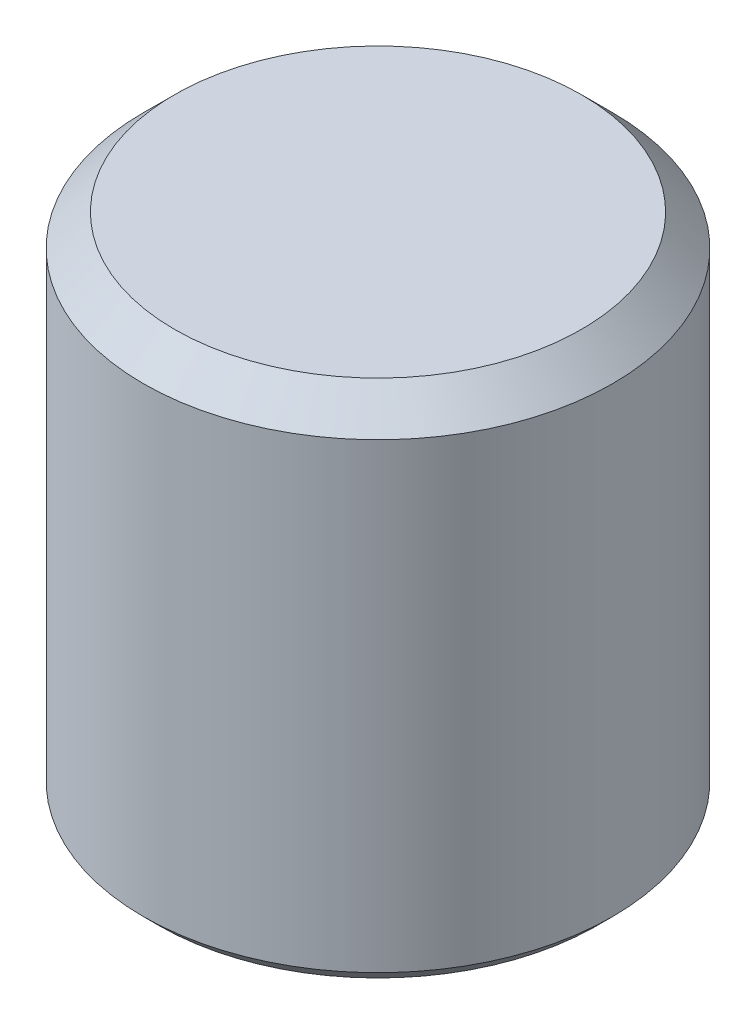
ISO-10303-21;
HEADER;
FILE_DESCRIPTION(('STEP AP214'),'2;1');
FILE_NAME('part.step','',(''),(''),'','','');
FILE_SCHEMA(('AUTOMOTIVE_DESIGN { 1 0 10303 214 1 1 1 1 }'));
ENDSEC;
DATA;
#1=APPLICATION_CONTEXT('core data for automotive mechanical design processes');
#2=APPLICATION_PROTOCOL_DEFINITION('international standard','automotive_design',2000,#1);
#3=PRODUCT_CONTEXT('',#1,'mechanical');
#4=PRODUCT('Part','Part','',(#3));
#5=PRODUCT_RELATED_PRODUCT_CATEGORY('part','',(#4));
#6=PRODUCT_DEFINITION_FORMATION('','',#4);
#7=PRODUCT_DEFINITION_CONTEXT('part definition',#1,'design');
#8=PRODUCT_DEFINITION('design','',#6,#7);
#9=PRODUCT_DEFINITION_SHAPE('','',#8);
#10=(LENGTH_UNIT() NAMED_UNIT(*) SI_UNIT(.MILLI.,.METRE.));
#11=(NAMED_UNIT(*) PLANE_ANGLE_UNIT() SI_UNIT($,.RADIAN.));
#12=(NAMED_UNIT(*) SI_UNIT($,.STERADIAN.) SOLID_ANGLE_UNIT());
#13=UNCERTAINTY_MEASURE_WITH_UNIT(LENGTH_MEASURE(1.E-05),#10,'distance_accuracy_value','');
#14=(GEOMETRIC_REPRESENTATION_CONTEXT(3) GLOBAL_UNCERTAINTY_ASSIGNED_CONTEXT((#13)) GLOBAL_UNIT_ASSIGNED_CONTEXT((#10,
#11,#12)) REPRESENTATION_CONTEXT('',''));
#15=CARTESIAN_POINT('',(0.,0.,0.));
#16=DIRECTION('',(0.,0.,1.));
#17=DIRECTION('',(1.,0.,0.));
#18=AXIS2_PLACEMENT_3D('',#15,#16,#17);
#19=CARTESIAN_POINT('',(0.,13.,0.));
#20=DIRECTION('',(0.,-1.,0.));
#21=DIRECTION('',(0.,0.,-1.));
#22=AXIS2_PLACEMENT_3D('',#19,#20,#21);
#23=CYLINDRICAL_SURFACE('',#22,6.);
#24=CARTESIAN_POINT('',(0.,0.40000000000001,0.));
#25=DIRECTION('',(0.,1.,0.));
#26=DIRECTION('',(0.,0.,1.));
#27=AXIS2_PLACEMENT_3D('',#24,#25,#26);
#28=CIRCLE('',#27,6.);
#29=CARTESIAN_POINT('',(0.,0.400000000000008,-6.));
#30=VERTEX_POINT('',#29);
#31=EDGE_CURVE('E10',#30,#30,#28,.T.);
#32=CARTESIAN_POINT('',(0.,12.2,0.));
#33=DIRECTION('',(0.,1.,0.));
#34=DIRECTION('',(0.,0.,1.));
#35=AXIS2_PLACEMENT_3D('',#32,#33,#34);
#36=CIRCLE('',#35,6.);
#37=CARTESIAN_POINT('',(0.,12.2,-6.));
#38=VERTEX_POINT('',#37);
#39=EDGE_CURVE('E59',#38,#38,#36,.F.);
#40=CARTESIAN_POINT('',(0.,0.400000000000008,-6.));
#41=CARTESIAN_POINT('',(0.,0.522916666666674,-6.));
#42=CARTESIAN_POINT('',(0.,0.645833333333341,-6.));
#43=CARTESIAN_POINT('',(0.,0.891666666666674,-6.));
#44=CARTESIAN_POINT('',(0.,1.01458333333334,-6.));
#45=CARTESIAN_POINT('',(0.,1.26041666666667,-6.));
#46=CARTESIAN_POINT('',(0.,1.38333333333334,-6.));
#47=CARTESIAN_POINT('',(0.,1.62916666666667,-6.));
#48=CARTESIAN_POINT('',(0.,1.75208333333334,-6.));
#49=CARTESIAN_POINT('',(0.,1.99791666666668,-6.));
#50=CARTESIAN_POINT('',(0.,2.12083333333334,-6.));
#51=CARTESIAN_POINT('',(0.,2.36666666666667,-6.));
#52=CARTESIAN_POINT('',(0.,2.48958333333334,-6.));
#53=CARTESIAN_POINT('',(0.,2.73541666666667,-6.));
#54=CARTESIAN_POINT('',(0.,2.85833333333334,-6.));
#55=CARTESIAN_POINT('',(0.,3.10416666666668,-6.));
#56=CARTESIAN_POINT('',(0.,3.22708333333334,-6.));
#57=CARTESIAN_POINT('',(0.,3.47291666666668,-6.));
#58=CARTESIAN_POINT('',(0.,3.59583333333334,-6.));
#59=CARTESIAN_POINT('',(0.,3.84166666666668,-6.));
#60=CARTESIAN_POINT('',(0.,3.96458333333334,-6.));
#61=CARTESIAN_POINT('',(0.,4.21041666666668,-6.));
#62=CARTESIAN_POINT('',(0.,4.33333333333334,-6.));
#63=CARTESIAN_POINT('',(0.,4.57916666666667,-6.));
#64=CARTESIAN_POINT('',(0.,4.70208333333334,-6.));
#65=CARTESIAN_POINT('',(0.,4.94791666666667,-6.));
#66=CARTESIAN_POINT('',(0.,5.07083333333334,-6.));
#67=CARTESIAN_POINT('',(0.,5.31666666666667,-6.));
#68=CARTESIAN_POINT('',(0.,5.43958333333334,-6.));
#69=CARTESIAN_POINT('',(0.,5.68541666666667,-6.));
#70=CARTESIAN_POINT('',(0.,5.80833333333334,-6.));
#71=CARTESIAN_POINT('',(0.,6.05416666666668,-6.));
#72=CARTESIAN_POINT('',(0.,6.17708333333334,-6.));
#73=CARTESIAN_POINT('',(0.,6.42291666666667,-6.));
#74=CARTESIAN_POINT('',(0.,6.54583333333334,-6.));
#75=CARTESIAN_POINT('',(0.,6.79166666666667,-6.));
#76=CARTESIAN_POINT('',(0.,6.91458333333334,-6.));
#77=CARTESIAN_POINT('',(0.,7.16041666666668,-6.));
#78=CARTESIAN_POINT('',(0.,7.28333333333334,-6.));
#79=CARTESIAN_POINT('',(0.,7.52916666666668,-6.));
#80=CARTESIAN_POINT('',(0.,7.65208333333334,-6.));
#81=CARTESIAN_POINT('',(0.,7.89791666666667,-6.));
#82=CARTESIAN_POINT('',(0.,8.02083333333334,-6.));
#83=CARTESIAN_POINT('',(0.,8.26666666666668,-6.));
#84=CARTESIAN_POINT('',(0.,8.38958333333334,-6.));
#85=CARTESIAN_POINT('',(0.,8.63541666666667,-6.));
#86=CARTESIAN_POINT('',(0.,8.75833333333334,-6.));
#87=CARTESIAN_POINT('',(0.,9.00416666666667,-6.));
#88=CARTESIAN_POINT('',(0.,9.12708333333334,-6.));
#89=CARTESIAN_POINT('',(0.,9.37291666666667,-6.));
#90=CARTESIAN_POINT('',(0.,9.49583333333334,-6.));
#91=CARTESIAN_POINT('',(0.,9.74166666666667,-6.));
#92=CARTESIAN_POINT('',(0.,9.86458333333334,-6.));
#93=CARTESIAN_POINT('',(0.,10.1104166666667,-6.));
#94=CARTESIAN_POINT('',(0.,10.2333333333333,-6.));
#95=CARTESIAN_POINT('',(0.,10.4791666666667,-6.));
#96=CARTESIAN_POINT('',(0.,10.6020833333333,-6.));
#97=CARTESIAN_POINT('',(0.,10.8479166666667,-6.));
#98=CARTESIAN_POINT('',(0.,10.9708333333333,-6.));
#99=CARTESIAN_POINT('',(0.,11.2166666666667,-6.));
#100=CARTESIAN_POINT('',(0.,11.3395833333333,-6.));
#101=CARTESIAN_POINT('',(0.,11.5854166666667,-6.));
#102=CARTESIAN_POINT('',(0.,11.7083333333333,-6.));
#103=CARTESIAN_POINT('',(0.,11.9541666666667,-6.));
#104=CARTESIAN_POINT('',(0.,12.0770833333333,-6.));
#105=CARTESIAN_POINT('',(0.,12.2,-6.));
#106=B_SPLINE_CURVE_WITH_KNOTS('',3,(#40,#41,#42,#43,#44,#45,#46,#47,#48,#49,#50,#51,#52,#53,
#54,#55,#56,#57,#58,#59,#60,#61,#62,#63,#64,#65,#66,#67,#68,#69,#70,#71,#72,#73,#74,#75,#76,#77,
#78,#79,#80,#81,#82,#83,#84,#85,#86,#87,#88,#89,#90,#91,#92,#93,#94,#95,#96,#97,#98,#99,#100,
#101,#102,#103,#104,#105),.UNSPECIFIED.,.F.,.F.,(4,2,2,2,2,2,2,2,2,2,2,2,2,2,2,2,2,2,2,2,2,2,2,
2,2,2,2,2,2,2,2,2,4),(0.,0.368749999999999,0.7375,1.10625,1.475,1.84375,2.2125,2.58125,2.95,
3.31875,3.6875,4.05625,4.425,4.79375,5.1625,5.53125,5.9,6.26875,6.6375,7.00625,7.375,7.74375,
8.1125,8.48125,8.85,9.21875,9.5875,9.95625,10.325,10.69375,11.0625,11.43125,11.8),.UNSPECIFIED.);
#107=EDGE_CURVE('BSEAM35',#30,#38,#106,.T.);
#108=ORIENTED_EDGE('',*,*,#31,.T.);
#109=ORIENTED_EDGE('',*,*,#39,.T.);
#110=ORIENTED_EDGE('',*,*,#107,.T.);
#111=ORIENTED_EDGE('',*,*,#107,.F.);
#112=EDGE_LOOP('',(#108,#110,#109,#111));
#113=FACE_BOUND('',#112,.T.);
#114=ADVANCED_FACE('F35',(#113),#23,.T.);
#115=CARTESIAN_POINT('',(0.,13.,0.));
#116=DIRECTION('',(0.,1.,0.));
#117=DIRECTION('',(0.,0.,1.));
#118=AXIS2_PLACEMENT_3D('',#115,#116,#117);
#119=PLANE('',#118);
#120=CARTESIAN_POINT('',(0.,13.,0.));
#121=DIRECTION('',(0.,1.,0.));
#122=DIRECTION('',(0.,0.,1.));
#123=AXIS2_PLACEMENT_3D('',#120,#121,#122);
#124=CIRCLE('',#123,5.20000000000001);
#125=CARTESIAN_POINT('',(0.,13.,5.20000000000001));
#126=VERTEX_POINT('',#125);
#127=EDGE_CURVE('E63',#126,#126,#124,.T.);
#128=ORIENTED_EDGE('',*,*,#127,.T.);
#129=EDGE_LOOP('',(#128));
#130=FACE_BOUND('',#129,.T.);
#131=ADVANCED_FACE('F85',(#130),#119,.T.);
#132=CARTESIAN_POINT('',(0.,0.,0.));
#133=DIRECTION('',(0.,1.,0.));
#134=DIRECTION('',(0.,0.,1.));
#135=AXIS2_PLACEMENT_3D('',#132,#133,#134);
#136=PLANE('',#135);
#137=CARTESIAN_POINT('',(0.,0.,0.));
#138=DIRECTION('',(0.,1.,0.));
#139=DIRECTION('',(0.,0.,1.));
#140=AXIS2_PLACEMENT_3D('',#137,#138,#139);
#141=CIRCLE('',#140,5.40000000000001);
#142=CARTESIAN_POINT('',(0.,0.,5.40000000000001));
#143=VERTEX_POINT('',#142);
#144=EDGE_CURVE('E43',#143,#143,#141,.T.);
#145=ORIENTED_EDGE('',*,*,#144,.T.);
#146=EDGE_LOOP('',(#145));
#147=FACE_BOUND('',#146,.T.);
#148=CARTESIAN_POINT('',(0.,0.,0.));
#149=DIRECTION('',(0.,1.,0.));
#150=DIRECTION('',(0.,0.,1.));
#151=AXIS2_PLACEMENT_3D('',#148,#149,#150);
#152=CIRCLE('',#151,5.59999999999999);
#153=CARTESIAN_POINT('',(0.,0.,5.59999999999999));
#154=VERTEX_POINT('',#153);
#155=EDGE_CURVE('E49',#154,#154,#152,.F.);
#156=ORIENTED_EDGE('',*,*,#155,.T.);
#157=EDGE_LOOP('',(#156));
#158=FACE_BOUND('',#157,.T.);
#159=ADVANCED_FACE('F76',(#147,#158),#136,.F.);
#160=CARTESIAN_POINT('',(0.,10.,0.));
#161=DIRECTION('',(0.,-1.,0.));
#162=DIRECTION('',(0.,0.,-1.));
#163=AXIS2_PLACEMENT_3D('',#160,#161,#162);
#164=CYLINDRICAL_SURFACE('',#163,5.);
#165=CARTESIAN_POINT('',(0.,0.400000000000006,0.));
#166=DIRECTION('',(0.,1.,0.));
#167=DIRECTION('',(0.,0.,1.));
#168=AXIS2_PLACEMENT_3D('',#165,#166,#167);
#169=CIRCLE('',#168,5.);
#170=CARTESIAN_POINT('',(0.,0.400000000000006,5.));
#171=VERTEX_POINT('',#170);
#172=EDGE_CURVE('E54',#171,#171,#169,.F.);
#173=ORIENTED_EDGE('',*,*,#172,.T.);
#174=EDGE_LOOP('',(#173));
#175=FACE_BOUND('',#174,.T.);
#176=CARTESIAN_POINT('',(0.,10.,0.));
#177=DIRECTION('',(0.,-1.,0.));
#178=DIRECTION('',(0.,0.,-1.));
#179=AXIS2_PLACEMENT_3D('',#176,#177,#178);
#180=CIRCLE('',#179,5.);
#181=CARTESIAN_POINT('',(0.,10.,-5.));
#182=VERTEX_POINT('',#181);
#183=EDGE_CURVE('E67',#182,#182,#180,.T.);
#184=ORIENTED_EDGE('',*,*,#183,.F.);
#185=EDGE_LOOP('',(#184));
#186=FACE_BOUND('',#185,.T.);
#187=ADVANCED_FACE('F74',(#175,#186),#164,.F.);
#188=CARTESIAN_POINT('',(0.,10.,0.));
#189=DIRECTION('',(0.,-1.,0.));
#190=DIRECTION('',(0.,0.,-1.));
#191=AXIS2_PLACEMENT_3D('',#188,#189,#190);
#192=PLANE('',#191);
#193=ORIENTED_EDGE('',*,*,#183,.T.);
#194=EDGE_LOOP('',(#193));
#195=FACE_BOUND('',#194,.T.);
#196=ADVANCED_FACE('F72',(#195),#192,.T.);
#197=CARTESIAN_POINT('',(0.,13.,0.));
#198=DIRECTION('',(0.,-1.,0.));
#199=DIRECTION('',(0.,0.,-1.));
#200=AXIS2_PLACEMENT_3D('',#197,#198,#199);
#201=CONICAL_SURFACE('',#200,5.20000000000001,0.785398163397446);
#202=ORIENTED_EDGE('',*,*,#39,.F.);
#203=EDGE_LOOP('',(#202));
#204=FACE_BOUND('',#203,.T.);
#205=ORIENTED_EDGE('',*,*,#127,.F.);
#206=EDGE_LOOP('',(#205));
#207=FACE_BOUND('',#206,.T.);
#208=ADVANCED_FACE('F83',(#204,#207),#201,.T.);
#209=CARTESIAN_POINT('',(0.,0.400000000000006,0.));
#210=DIRECTION('',(0.,-1.,0.));
#211=DIRECTION('',(0.,0.,-1.));
#212=AXIS2_PLACEMENT_3D('',#209,#210,#211);
#213=CONICAL_SURFACE('',#212,5.,0.785398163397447);
#214=ORIENTED_EDGE('',*,*,#144,.F.);
#215=EDGE_LOOP('',(#214));
#216=FACE_BOUND('',#215,.T.);
#217=ORIENTED_EDGE('',*,*,#172,.F.);
#218=EDGE_LOOP('',(#217));
#219=FACE_BOUND('',#218,.T.);
#220=ADVANCED_FACE('F97',(#216,#219),#213,.F.);
#221=CARTESIAN_POINT('',(0.,0.40000000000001,0.));
#222=DIRECTION('',(0.,1.,0.));
#223=DIRECTION('',(0.,0.,1.));
#224=AXIS2_PLACEMENT_3D('',#221,#222,#223);
#225=CONICAL_SURFACE('',#224,6.,0.78539816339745);
#226=ORIENTED_EDGE('',*,*,#155,.F.);
#227=EDGE_LOOP('',(#226));
#228=FACE_BOUND('',#227,.T.);
#229=ORIENTED_EDGE('',*,*,#31,.F.);
#230=EDGE_LOOP('',(#229));
#231=FACE_BOUND('',#230,.T.);
#232=ADVANCED_FACE('F37',(#228,#231),#225,.T.);
#233=CLOSED_SHELL('',(#114,#131,#159,#187,#196,#208,#220,#232));
#234=MANIFOLD_SOLID_BREP('B2',#233);
#235=ADVANCED_BREP_SHAPE_REPRESENTATION('',(#18,#234),#14);
#236=SHAPE_DEFINITION_REPRESENTATION(#9,#235);
ENDSEC;
END-ISO-10303-21;
